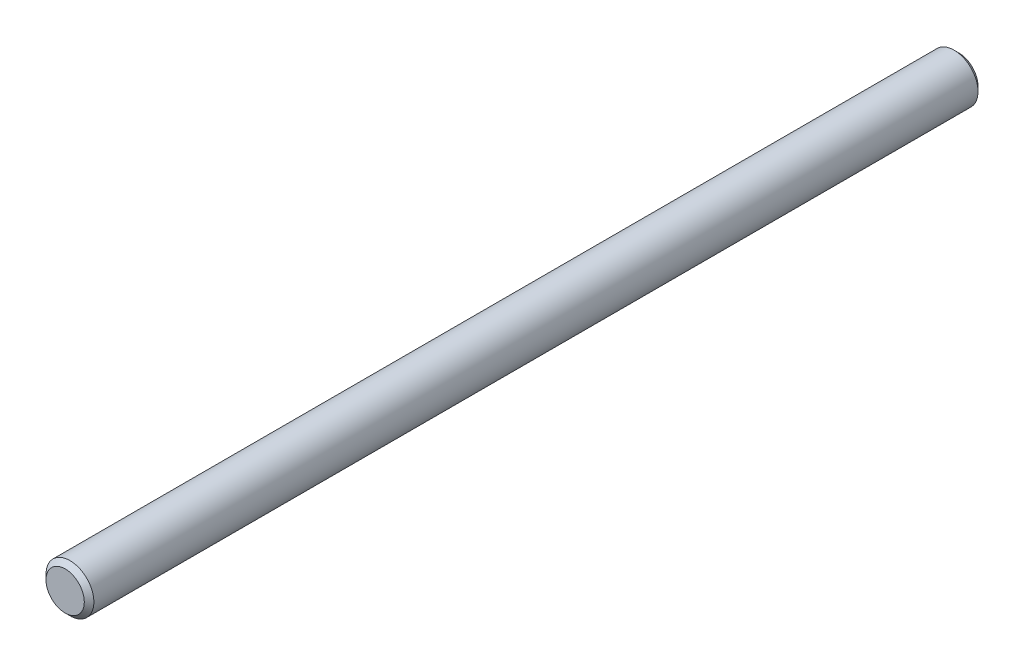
from build123d import *

# Parameters (mm, degrees)
ESQUISSE1_R      = 1.5
EXTRUSION1_DEPTH = 56
CHANFREIN1_SIZE  = 0.3


with BuildPart() as part:
    # Esquisse1 → Extrusion1 (new body)
    with BuildSketch(Plane.XY):
        Circle(ESQUISSE1_R)
    extrude(amount=EXTRUSION1_DEPTH)

    # Chanfrein1
    chanfrein1_edges = [part.edges().sort_by_distance(p)[0] for p in [
        (-1.5, 0, 0),
        (-1.5, 0, 56),
    ]]
    chamfer(chanfrein1_edges, length=CHANFREIN1_SIZE)


solid = part.part
